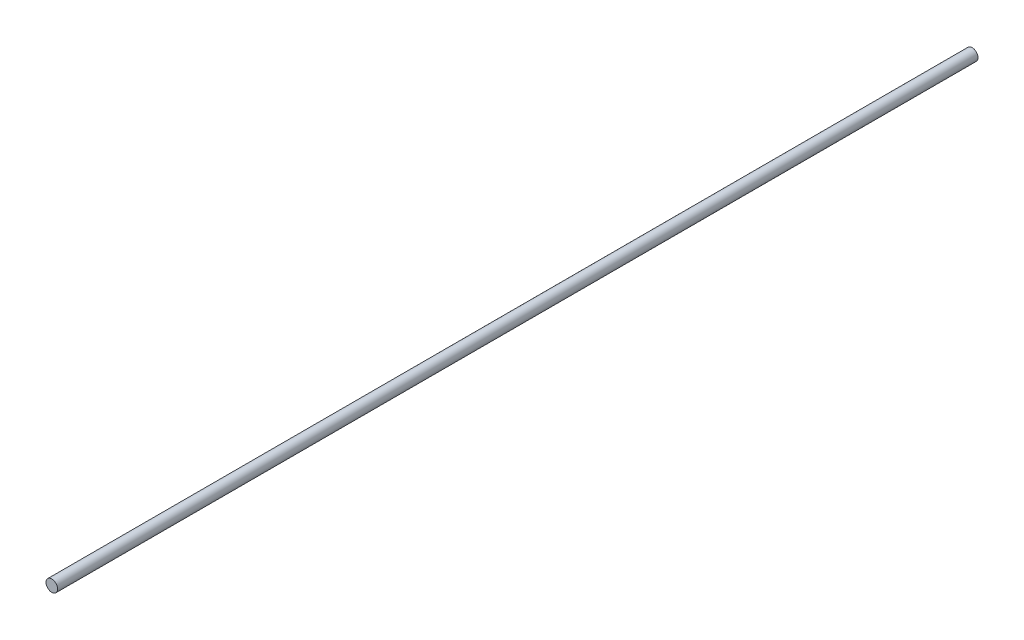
from build123d import *

# Parameters (mm, degrees)
SKETCH1_R           = 30
BOSS_EXTRUDE1_DEPTH = 4750


with BuildPart() as part:
    # Sketch1 → Boss-Extrude1 (new body)
    with BuildSketch(Plane.XY):
        Circle(SKETCH1_R)
    extrude(amount=-BOSS_EXTRUDE1_DEPTH)


solid = part.part
